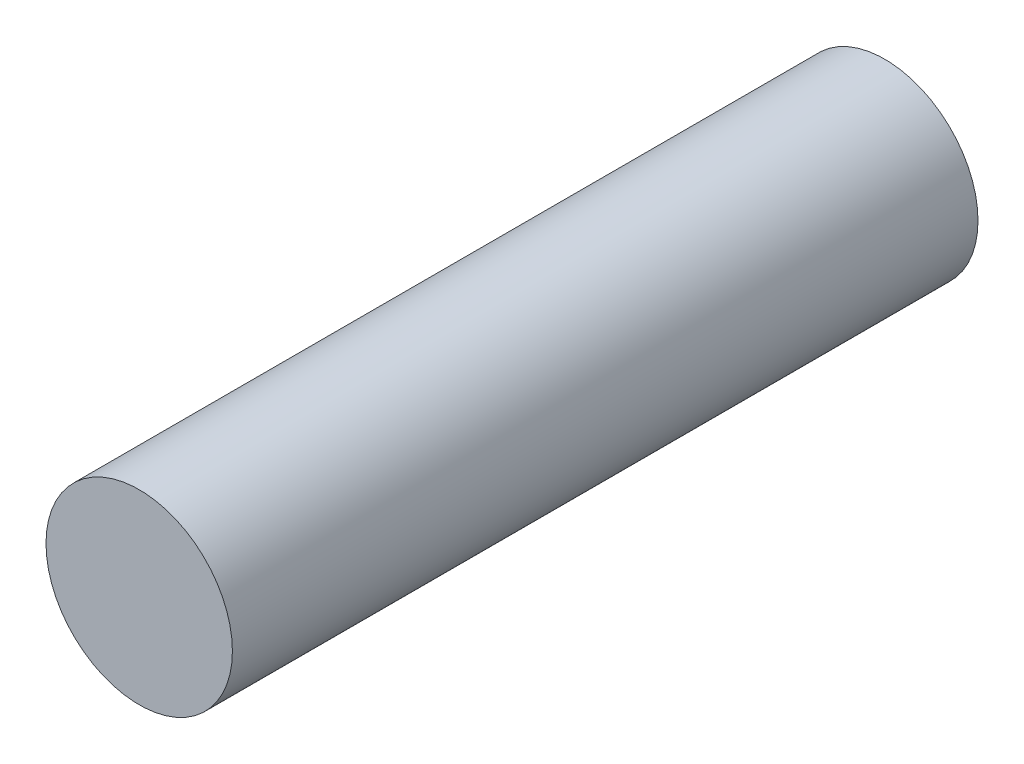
from build123d import *

# Parameters (mm, degrees)
ESQUISSE1_R        = 0.5
BOSS_EXTRU_1_DEPTH = 2


with BuildPart() as part:
    # Esquisse1 → Boss.-Extru.1 (new, symmetric)
    with BuildSketch(Plane.XY):
        Circle(ESQUISSE1_R)
    extrude(amount=BOSS_EXTRU_1_DEPTH, both=True)


solid = part.part
